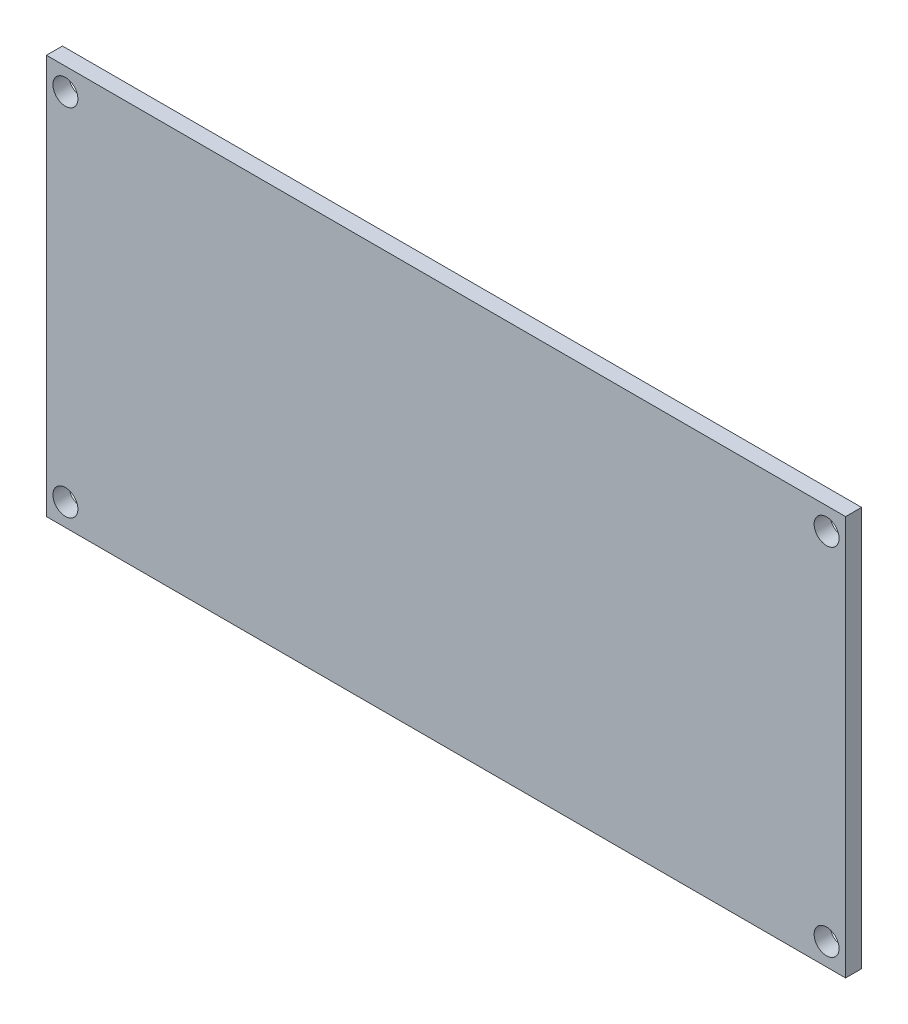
ISO-10303-21;
HEADER;
FILE_DESCRIPTION(('STEP AP214'),'2;1');
FILE_NAME('part.step','',(''),(''),'','','');
FILE_SCHEMA(('AUTOMOTIVE_DESIGN { 1 0 10303 214 1 1 1 1 }'));
ENDSEC;
DATA;
#1=APPLICATION_CONTEXT('core data for automotive mechanical design processes');
#2=APPLICATION_PROTOCOL_DEFINITION('international standard','automotive_design',2000,#1);
#3=PRODUCT_CONTEXT('',#1,'mechanical');
#4=PRODUCT('Part','Part','',(#3));
#5=PRODUCT_RELATED_PRODUCT_CATEGORY('part','',(#4));
#6=PRODUCT_DEFINITION_FORMATION('','',#4);
#7=PRODUCT_DEFINITION_CONTEXT('part definition',#1,'design');
#8=PRODUCT_DEFINITION('design','',#6,#7);
#9=PRODUCT_DEFINITION_SHAPE('','',#8);
#10=(LENGTH_UNIT() NAMED_UNIT(*) SI_UNIT(.MILLI.,.METRE.));
#11=(NAMED_UNIT(*) PLANE_ANGLE_UNIT() SI_UNIT($,.RADIAN.));
#12=(NAMED_UNIT(*) SI_UNIT($,.STERADIAN.) SOLID_ANGLE_UNIT());
#13=UNCERTAINTY_MEASURE_WITH_UNIT(LENGTH_MEASURE(1.E-05),#10,'distance_accuracy_value','');
#14=(GEOMETRIC_REPRESENTATION_CONTEXT(3) GLOBAL_UNCERTAINTY_ASSIGNED_CONTEXT((#13)) GLOBAL_UNIT_ASSIGNED_CONTEXT((#10,
#11,#12)) REPRESENTATION_CONTEXT('',''));
#15=CARTESIAN_POINT('',(0.,0.,0.));
#16=DIRECTION('',(0.,0.,1.));
#17=DIRECTION('',(1.,0.,0.));
#18=AXIS2_PLACEMENT_3D('',#15,#16,#17);
#19=CARTESIAN_POINT('',(0.,0.,1.6));
#20=DIRECTION('',(0.,0.,1.));
#21=DIRECTION('',(1.,0.,0.));
#22=AXIS2_PLACEMENT_3D('',#19,#20,#21);
#23=PLANE('',#22);
#24=CARTESIAN_POINT('',(38.1,-17.78,1.6));
#25=DIRECTION('',(0.,0.,1.));
#26=DIRECTION('',(1.,0.,0.));
#27=AXIS2_PLACEMENT_3D('',#24,#25,#26);
#28=CIRCLE('',#27,1.25);
#29=CARTESIAN_POINT('',(39.35,-17.78,1.6));
#30=VERTEX_POINT('',#29);
#31=EDGE_CURVE('E122',#30,#30,#28,.T.);
#32=ORIENTED_EDGE('',*,*,#31,.F.);
#33=EDGE_LOOP('',(#32));
#34=FACE_BOUND('',#33,.T.);
#35=CARTESIAN_POINT('',(-38.1,17.78,1.6));
#36=DIRECTION('',(0.,0.,1.));
#37=DIRECTION('',(1.,0.,0.));
#38=AXIS2_PLACEMENT_3D('',#35,#36,#37);
#39=CIRCLE('',#38,1.25);
#40=CARTESIAN_POINT('',(-36.85,17.78,1.6));
#41=VERTEX_POINT('',#40);
#42=EDGE_CURVE('E101',#41,#41,#39,.T.);
#43=ORIENTED_EDGE('',*,*,#42,.F.);
#44=EDGE_LOOP('',(#43));
#45=FACE_BOUND('',#44,.T.);
#46=DIRECTION('',(0.,-1.,0.));
#47=VECTOR('',#46,1.);
#48=CARTESIAN_POINT('',(-40.,20.,1.6));
#49=LINE('',#48,#47);
#50=CARTESIAN_POINT('',(-40.,20.,1.6));
#51=VERTEX_POINT('',#50);
#52=CARTESIAN_POINT('',(-40.,-20.,1.6));
#53=VERTEX_POINT('',#52);
#54=EDGE_CURVE('E86',#51,#53,#49,.T.);
#55=ORIENTED_EDGE('',*,*,#54,.T.);
#56=DIRECTION('',(1.,0.,0.));
#57=VECTOR('',#56,1.);
#58=CARTESIAN_POINT('',(-40.,-20.,1.6));
#59=LINE('',#58,#57);
#60=CARTESIAN_POINT('',(40.,-20.,1.6));
#61=VERTEX_POINT('',#60);
#62=EDGE_CURVE('E81',#53,#61,#59,.T.);
#63=ORIENTED_EDGE('',*,*,#62,.T.);
#64=DIRECTION('',(0.,1.,0.));
#65=VECTOR('',#64,1.);
#66=CARTESIAN_POINT('',(40.,20.,1.6));
#67=LINE('',#66,#65);
#68=CARTESIAN_POINT('',(40.,20.,1.6));
#69=VERTEX_POINT('',#68);
#70=EDGE_CURVE('E84',#61,#69,#67,.T.);
#71=ORIENTED_EDGE('',*,*,#70,.T.);
#72=DIRECTION('',(-1.,0.,0.));
#73=VECTOR('',#72,1.);
#74=CARTESIAN_POINT('',(-40.,20.,1.6));
#75=LINE('',#74,#73);
#76=EDGE_CURVE('E51',#69,#51,#75,.T.);
#77=ORIENTED_EDGE('',*,*,#76,.T.);
#78=EDGE_LOOP('',(#55,#63,#71,#77));
#79=FACE_BOUND('',#78,.T.);
#80=CARTESIAN_POINT('',(-38.1,-17.78,1.6));
#81=DIRECTION('',(0.,0.,1.));
#82=DIRECTION('',(-1.,0.,0.));
#83=AXIS2_PLACEMENT_3D('',#80,#81,#82);
#84=CIRCLE('',#83,1.25);
#85=CARTESIAN_POINT('',(-39.35,-17.78,1.6));
#86=VERTEX_POINT('',#85);
#87=EDGE_CURVE('E116',#86,#86,#84,.T.);
#88=ORIENTED_EDGE('',*,*,#87,.F.);
#89=EDGE_LOOP('',(#88));
#90=FACE_BOUND('',#89,.T.);
#91=CARTESIAN_POINT('',(38.1,17.78,1.6));
#92=DIRECTION('',(0.,0.,1.));
#93=DIRECTION('',(-1.,0.,0.));
#94=AXIS2_PLACEMENT_3D('',#91,#92,#93);
#95=CIRCLE('',#94,1.25);
#96=CARTESIAN_POINT('',(36.85,17.78,1.6));
#97=VERTEX_POINT('',#96);
#98=EDGE_CURVE('E128',#97,#97,#95,.T.);
#99=ORIENTED_EDGE('',*,*,#98,.F.);
#100=EDGE_LOOP('',(#99));
#101=FACE_BOUND('',#100,.T.);
#102=ADVANCED_FACE('F34',(#34,#45,#79,#90,#101),#23,.T.);
#103=CARTESIAN_POINT('',(0.,0.,0.));
#104=DIRECTION('',(0.,0.,1.));
#105=DIRECTION('',(1.,0.,0.));
#106=AXIS2_PLACEMENT_3D('',#103,#104,#105);
#107=PLANE('',#106);
#108=DIRECTION('',(0.,-1.,0.));
#109=VECTOR('',#108,1.);
#110=CARTESIAN_POINT('',(-40.,20.,0.));
#111=LINE('',#110,#109);
#112=CARTESIAN_POINT('',(-40.,20.,0.));
#113=VERTEX_POINT('',#112);
#114=CARTESIAN_POINT('',(-40.,-20.,0.));
#115=VERTEX_POINT('',#114);
#116=EDGE_CURVE('E98',#113,#115,#111,.T.);
#117=ORIENTED_EDGE('',*,*,#116,.F.);
#118=DIRECTION('',(-1.,0.,0.));
#119=VECTOR('',#118,1.);
#120=CARTESIAN_POINT('',(-40.,20.,0.));
#121=LINE('',#120,#119);
#122=CARTESIAN_POINT('',(40.,20.,0.));
#123=VERTEX_POINT('',#122);
#124=EDGE_CURVE('E74',#123,#113,#121,.T.);
#125=ORIENTED_EDGE('',*,*,#124,.F.);
#126=DIRECTION('',(0.,1.,0.));
#127=VECTOR('',#126,1.);
#128=CARTESIAN_POINT('',(40.,20.,0.));
#129=LINE('',#128,#127);
#130=CARTESIAN_POINT('',(40.,-20.,0.));
#131=VERTEX_POINT('',#130);
#132=EDGE_CURVE('E68',#131,#123,#129,.T.);
#133=ORIENTED_EDGE('',*,*,#132,.F.);
#134=DIRECTION('',(1.,0.,0.));
#135=VECTOR('',#134,1.);
#136=CARTESIAN_POINT('',(-40.,-20.,0.));
#137=LINE('',#136,#135);
#138=EDGE_CURVE('E90',#115,#131,#137,.T.);
#139=ORIENTED_EDGE('',*,*,#138,.F.);
#140=EDGE_LOOP('',(#117,#125,#133,#139));
#141=FACE_BOUND('',#140,.T.);
#142=CARTESIAN_POINT('',(-38.1,17.78,0.));
#143=DIRECTION('',(0.,0.,1.));
#144=DIRECTION('',(1.,0.,0.));
#145=AXIS2_PLACEMENT_3D('',#142,#143,#144);
#146=CIRCLE('',#145,1.25);
#147=CARTESIAN_POINT('',(-36.85,17.78,0.));
#148=VERTEX_POINT('',#147);
#149=EDGE_CURVE('E113',#148,#148,#146,.T.);
#150=ORIENTED_EDGE('',*,*,#149,.T.);
#151=EDGE_LOOP('',(#150));
#152=FACE_BOUND('',#151,.T.);
#153=CARTESIAN_POINT('',(-38.1,-17.78,0.));
#154=DIRECTION('',(0.,0.,1.));
#155=DIRECTION('',(-1.,0.,0.));
#156=AXIS2_PLACEMENT_3D('',#153,#154,#155);
#157=CIRCLE('',#156,1.25);
#158=CARTESIAN_POINT('',(-39.35,-17.78,0.));
#159=VERTEX_POINT('',#158);
#160=EDGE_CURVE('E119',#159,#159,#157,.T.);
#161=ORIENTED_EDGE('',*,*,#160,.T.);
#162=EDGE_LOOP('',(#161));
#163=FACE_BOUND('',#162,.T.);
#164=CARTESIAN_POINT('',(38.1,-17.78,0.));
#165=DIRECTION('',(0.,0.,1.));
#166=DIRECTION('',(1.,0.,0.));
#167=AXIS2_PLACEMENT_3D('',#164,#165,#166);
#168=CIRCLE('',#167,1.25);
#169=CARTESIAN_POINT('',(39.35,-17.78,0.));
#170=VERTEX_POINT('',#169);
#171=EDGE_CURVE('E125',#170,#170,#168,.T.);
#172=ORIENTED_EDGE('',*,*,#171,.T.);
#173=EDGE_LOOP('',(#172));
#174=FACE_BOUND('',#173,.T.);
#175=CARTESIAN_POINT('',(38.1,17.78,0.));
#176=DIRECTION('',(0.,0.,1.));
#177=DIRECTION('',(-1.,0.,0.));
#178=AXIS2_PLACEMENT_3D('',#175,#176,#177);
#179=CIRCLE('',#178,1.25);
#180=CARTESIAN_POINT('',(36.85,17.78,0.));
#181=VERTEX_POINT('',#180);
#182=EDGE_CURVE('E131',#181,#181,#179,.T.);
#183=ORIENTED_EDGE('',*,*,#182,.T.);
#184=EDGE_LOOP('',(#183));
#185=FACE_BOUND('',#184,.T.);
#186=ADVANCED_FACE('F109',(#141,#152,#163,#174,#185),#107,.F.);
#187=CARTESIAN_POINT('',(-40.,20.,1.6));
#188=DIRECTION('',(1.,0.,0.));
#189=DIRECTION('',(0.,0.,-1.));
#190=AXIS2_PLACEMENT_3D('',#187,#188,#189);
#191=PLANE('',#190);
#192=ORIENTED_EDGE('',*,*,#116,.T.);
#193=DIRECTION('',(0.,0.,-1.));
#194=VECTOR('',#193,1.);
#195=CARTESIAN_POINT('',(-40.,-20.,1.6));
#196=LINE('',#195,#194);
#197=EDGE_CURVE('E11',#53,#115,#196,.T.);
#198=ORIENTED_EDGE('',*,*,#197,.F.);
#199=ORIENTED_EDGE('',*,*,#54,.F.);
#200=DIRECTION('',(0.,0.,-1.));
#201=VECTOR('',#200,1.);
#202=CARTESIAN_POINT('',(-40.,20.,1.6));
#203=LINE('',#202,#201);
#204=EDGE_CURVE('E94',#51,#113,#203,.T.);
#205=ORIENTED_EDGE('',*,*,#204,.T.);
#206=EDGE_LOOP('',(#192,#198,#199,#205));
#207=FACE_BOUND('',#206,.T.);
#208=ADVANCED_FACE('F36',(#207),#191,.F.);
#209=CARTESIAN_POINT('',(-40.,-20.,1.6));
#210=DIRECTION('',(0.,1.,0.));
#211=DIRECTION('',(0.,0.,1.));
#212=AXIS2_PLACEMENT_3D('',#209,#210,#211);
#213=PLANE('',#212);
#214=ORIENTED_EDGE('',*,*,#138,.T.);
#215=DIRECTION('',(0.,0.,-1.));
#216=VECTOR('',#215,1.);
#217=CARTESIAN_POINT('',(40.,-20.,1.6));
#218=LINE('',#217,#216);
#219=EDGE_CURVE('E43',#61,#131,#218,.T.);
#220=ORIENTED_EDGE('',*,*,#219,.F.);
#221=ORIENTED_EDGE('',*,*,#62,.F.);
#222=ORIENTED_EDGE('',*,*,#197,.T.);
#223=EDGE_LOOP('',(#214,#220,#221,#222));
#224=FACE_BOUND('',#223,.T.);
#225=ADVANCED_FACE('F89',(#224),#213,.F.);
#226=CARTESIAN_POINT('',(40.,20.,1.6));
#227=DIRECTION('',(-1.,0.,0.));
#228=DIRECTION('',(0.,0.,1.));
#229=AXIS2_PLACEMENT_3D('',#226,#227,#228);
#230=PLANE('',#229);
#231=ORIENTED_EDGE('',*,*,#132,.T.);
#232=DIRECTION('',(0.,0.,-1.));
#233=VECTOR('',#232,1.);
#234=CARTESIAN_POINT('',(40.,20.,1.6));
#235=LINE('',#234,#233);
#236=EDGE_CURVE('E91',#69,#123,#235,.T.);
#237=ORIENTED_EDGE('',*,*,#236,.F.);
#238=ORIENTED_EDGE('',*,*,#70,.F.);
#239=ORIENTED_EDGE('',*,*,#219,.T.);
#240=EDGE_LOOP('',(#231,#237,#238,#239));
#241=FACE_BOUND('',#240,.T.);
#242=ADVANCED_FACE('F92',(#241),#230,.F.);
#243=CARTESIAN_POINT('',(-40.,20.,1.6));
#244=DIRECTION('',(0.,-1.,0.));
#245=DIRECTION('',(0.,0.,-1.));
#246=AXIS2_PLACEMENT_3D('',#243,#244,#245);
#247=PLANE('',#246);
#248=ORIENTED_EDGE('',*,*,#124,.T.);
#249=ORIENTED_EDGE('',*,*,#204,.F.);
#250=ORIENTED_EDGE('',*,*,#76,.F.);
#251=ORIENTED_EDGE('',*,*,#236,.T.);
#252=EDGE_LOOP('',(#248,#249,#250,#251));
#253=FACE_BOUND('',#252,.T.);
#254=ADVANCED_FACE('F106',(#253),#247,.F.);
#255=CARTESIAN_POINT('',(-38.1,17.78,1.6));
#256=DIRECTION('',(0.,0.,-1.));
#257=DIRECTION('',(-1.,0.,0.));
#258=AXIS2_PLACEMENT_3D('',#255,#256,#257);
#259=CYLINDRICAL_SURFACE('',#258,1.25);
#260=ORIENTED_EDGE('',*,*,#42,.T.);
#261=EDGE_LOOP('',(#260));
#262=FACE_BOUND('',#261,.T.);
#263=ORIENTED_EDGE('',*,*,#149,.F.);
#264=EDGE_LOOP('',(#263));
#265=FACE_BOUND('',#264,.T.);
#266=ADVANCED_FACE('F150',(#262,#265),#259,.F.);
#267=CARTESIAN_POINT('',(-38.1,-17.78,1.6));
#268=DIRECTION('',(0.,0.,-1.));
#269=DIRECTION('',(-1.,0.,0.));
#270=AXIS2_PLACEMENT_3D('',#267,#268,#269);
#271=CYLINDRICAL_SURFACE('',#270,1.25);
#272=ORIENTED_EDGE('',*,*,#87,.T.);
#273=EDGE_LOOP('',(#272));
#274=FACE_BOUND('',#273,.T.);
#275=ORIENTED_EDGE('',*,*,#160,.F.);
#276=EDGE_LOOP('',(#275));
#277=FACE_BOUND('',#276,.T.);
#278=ADVANCED_FACE('F200',(#274,#277),#271,.F.);
#279=CARTESIAN_POINT('',(38.1,-17.78,1.6));
#280=DIRECTION('',(0.,0.,-1.));
#281=DIRECTION('',(-1.,0.,0.));
#282=AXIS2_PLACEMENT_3D('',#279,#280,#281);
#283=CYLINDRICAL_SURFACE('',#282,1.25);
#284=ORIENTED_EDGE('',*,*,#31,.T.);
#285=EDGE_LOOP('',(#284));
#286=FACE_BOUND('',#285,.T.);
#287=ORIENTED_EDGE('',*,*,#171,.F.);
#288=EDGE_LOOP('',(#287));
#289=FACE_BOUND('',#288,.T.);
#290=ADVANCED_FACE('F208',(#286,#289),#283,.F.);
#291=CARTESIAN_POINT('',(38.1,17.78,1.6));
#292=DIRECTION('',(0.,0.,-1.));
#293=DIRECTION('',(-1.,0.,0.));
#294=AXIS2_PLACEMENT_3D('',#291,#292,#293);
#295=CYLINDRICAL_SURFACE('',#294,1.25);
#296=ORIENTED_EDGE('',*,*,#98,.T.);
#297=EDGE_LOOP('',(#296));
#298=FACE_BOUND('',#297,.T.);
#299=ORIENTED_EDGE('',*,*,#182,.F.);
#300=EDGE_LOOP('',(#299));
#301=FACE_BOUND('',#300,.T.);
#302=ADVANCED_FACE('F137',(#298,#301),#295,.F.);
#303=CLOSED_SHELL('',(#102,#186,#208,#225,#242,#254,#266,#278,#290,#302));
#304=MANIFOLD_SOLID_BREP('B2',#303);
#305=ADVANCED_BREP_SHAPE_REPRESENTATION('',(#18,#304),#14);
#306=SHAPE_DEFINITION_REPRESENTATION(#9,#305);
ENDSEC;
END-ISO-10303-21;
